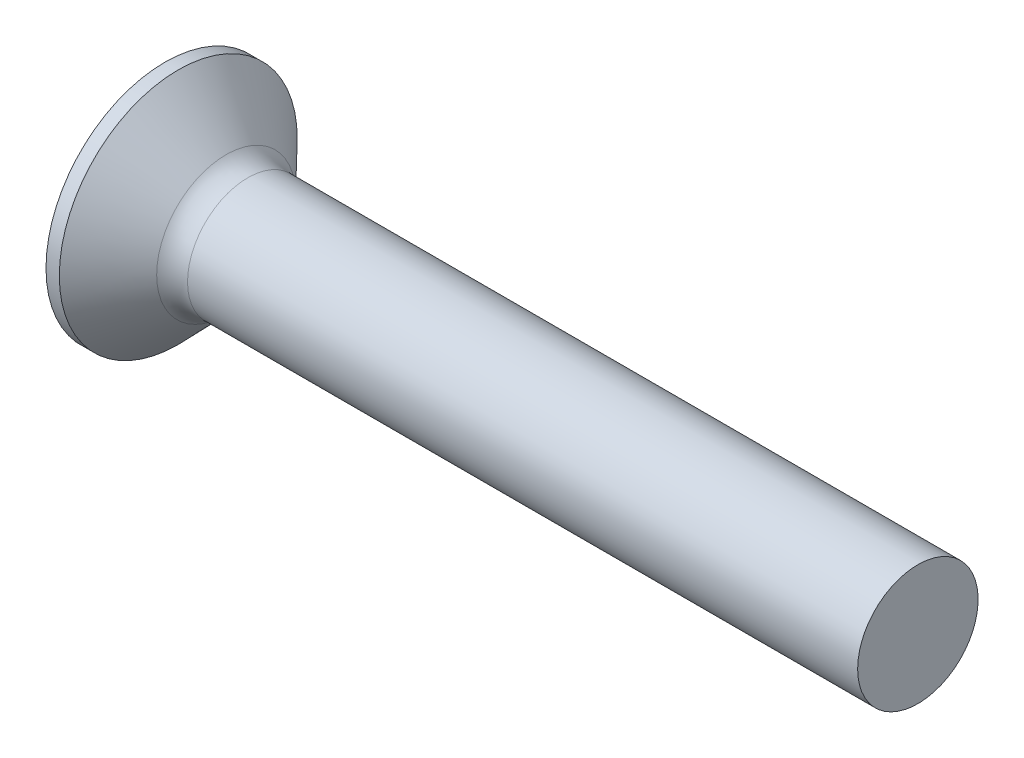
from build123d import *

# Parameters (mm, degrees)
FILLET1_R    = 2
RECPAT_COUNT = 2
RECPAT_ANGLE = 90


with BuildPart() as part:
    # BodySke → BaseBody (revolve)
    with BuildSketch(Plane.XY, mode=Mode.PRIVATE) as basebody_sk:
        Polygon((0, 0), (0, 7.9), (0.883813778, 7.9), (4.65, 4), (50, 4), (50, 0), align=None)
    revolve(basebody_sk.sketch.rotate(Axis((0, 0, 0), (1, 0, 0)), 90), axis=Axis((0, 0, 0), (1, 0, 0)))

    # Fillet1
    fillet1_edges = [part.edges().sort_by_distance(p)[0] for p in [
        (4.65, 0, -4),
    ]]
    fillet(fillet1_edges, radius=FILLET1_R)

    # RecSkeTop → Recess section 0
    with BuildSketch(Plane.ZY):
        with BuildLine():
            Line((-0.968, 4.4), (0.968, 4.4))
            Line((0.968, 4.4), (0.968, -4.4))
            Line((0.968, -4.4), (-0.968, -4.4))
            Line((-0.968, -4.4), (-0.968, 4.4))
        make_face()
    # RecSkeBot → Recess section 1
    with BuildSketch(Plane(origin=(4.96, 0, 0), x_dir=(0, 0, -1), z_dir=(1, 0, 0))):
        with BuildLine():
            Line((0.968, 1.927035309), (-0.968, 1.927035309))
            Line((-0.968, 1.927035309), (-0.968, -1.927035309))
            Line((-0.968, -1.927035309), (0.968, -1.927035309))
            Line((0.968, -1.927035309), (0.968, 1.927035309))
        make_face()
    recess = loft(mode=Mode.SUBTRACT)

    # RecPat: Recess ×2 about axis
    recpat_axis = Axis((0, 0, 0), (1, 0, 0))
    for i in range(1, RECPAT_COUNT):
        add(recess.rotate(recpat_axis, i * RECPAT_ANGLE / (RECPAT_COUNT - 1)), mode=Mode.SUBTRACT)

    # RecCorSke → RecessCore (revolve, cut)
    with BuildSketch(Plane.XY, mode=Mode.PRIVATE) as recesscore_sk:
        Polygon((0, 0), (0, 2.1296), (4.96, 1.782763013), (5.539254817, 0), align=None)
    revolve(recesscore_sk.sketch.rotate(Axis((0, 0, 0), (1, 0, 0)), 90), axis=Axis((0, 0, 0), (1, 0, 0)), mode=Mode.SUBTRACT)


solid = part.part
